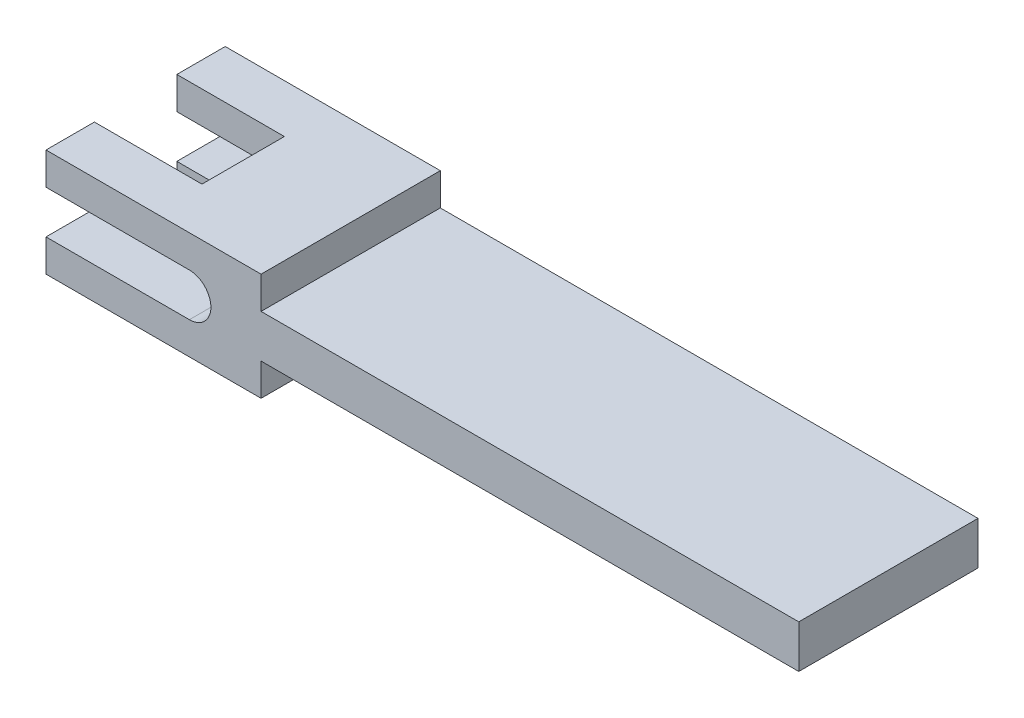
from build123d import *

# Parameters (mm, degrees)
EXTRUSION1_DEPTH        = 25
ENL_V_START             = -30
ESQUISSE2_W             = 46.725330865
ESQUISSE2_H             = 23
ENL_V_MAT_EXTRU_1_DEPTH = 30
ESQUISSE3_W             = 50
ESQUISSE3_H             = 12
EXTRUSION2_DEPTH        = 150


with BuildPart() as part:
    # Esquisse1 → Extrusion1 (new, symmetric)
    with BuildSketch(Plane.XY):
        with BuildLine():
            Line((0, 6), (-40, 6))
            Line((-40, 6), (-40, 15))
            Line((-40, 15), (20, 15))
            Line((20, 15), (20, -15))
            Line((20, -15), (-40, -15))
            Line((-40, -15), (-40, -6))
            Line((-40, -6), (0, -6))
            ThreePointArc((0, -6), (6, 0), (0, 6))
        make_face()
    extrude(amount=EXTRUSION1_DEPTH, both=True)

    # Esquisse2 → Enl_v. mat.-Extru.1 (cut)
    with BuildSketch(Plane(origin=(0, 15, 0), x_dir=(-1, 0, 0), z_dir=(0, 1, 0)).offset(ENL_V_START)):
        with Locations((33.362665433, 0)):
            Rectangle(ESQUISSE2_W, ESQUISSE2_H)
    extrude(amount=ENL_V_MAT_EXTRU_1_DEPTH, mode=Mode.SUBTRACT)

    # Esquisse3 → Extrusion2 (add)
    with BuildSketch(Plane(origin=(20, 0, 0), x_dir=(0, 0, -1), z_dir=(1, 0, 0))):
        Rectangle(ESQUISSE3_W, ESQUISSE3_H)
    extrude(amount=EXTRUSION2_DEPTH)


solid = part.part
